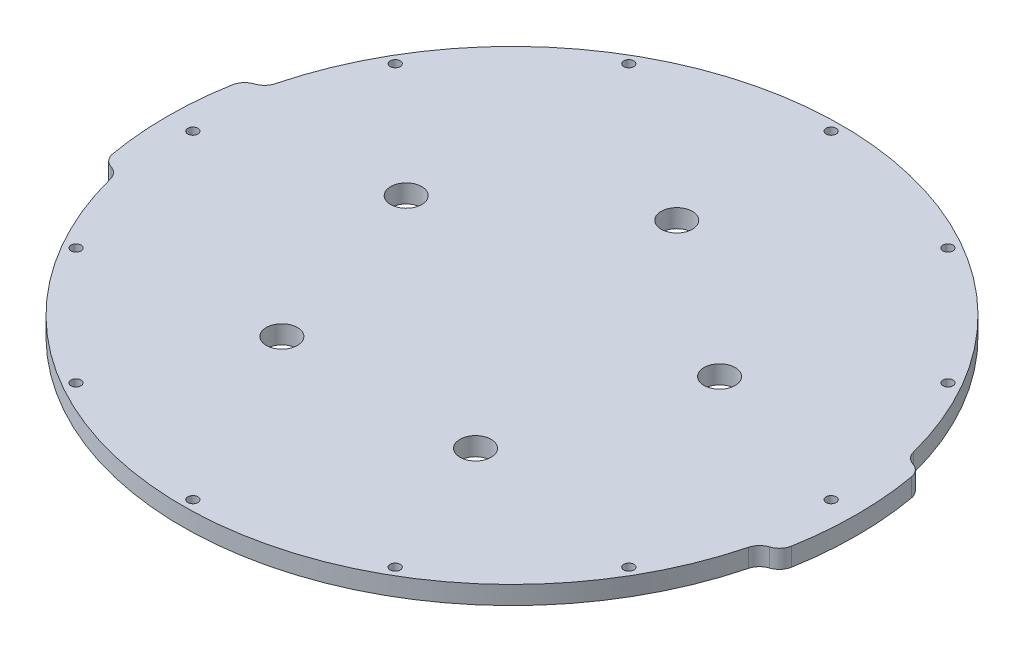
ISO-10303-21;
HEADER;
FILE_DESCRIPTION(('STEP AP214'),'2;1');
FILE_NAME('part.step','',(''),(''),'','','');
FILE_SCHEMA(('AUTOMOTIVE_DESIGN { 1 0 10303 214 1 1 1 1 }'));
ENDSEC;
DATA;
#1=APPLICATION_CONTEXT('core data for automotive mechanical design processes');
#2=APPLICATION_PROTOCOL_DEFINITION('international standard','automotive_design',2000,#1);
#3=PRODUCT_CONTEXT('',#1,'mechanical');
#4=PRODUCT('Part','Part','',(#3));
#5=PRODUCT_RELATED_PRODUCT_CATEGORY('part','',(#4));
#6=PRODUCT_DEFINITION_FORMATION('','',#4);
#7=PRODUCT_DEFINITION_CONTEXT('part definition',#1,'design');
#8=PRODUCT_DEFINITION('design','',#6,#7);
#9=PRODUCT_DEFINITION_SHAPE('','',#8);
#10=(LENGTH_UNIT() NAMED_UNIT(*) SI_UNIT(.MILLI.,.METRE.));
#11=(NAMED_UNIT(*) PLANE_ANGLE_UNIT() SI_UNIT($,.RADIAN.));
#12=(NAMED_UNIT(*) SI_UNIT($,.STERADIAN.) SOLID_ANGLE_UNIT());
#13=UNCERTAINTY_MEASURE_WITH_UNIT(LENGTH_MEASURE(1.E-05),#10,'distance_accuracy_value','');
#14=(GEOMETRIC_REPRESENTATION_CONTEXT(3) GLOBAL_UNCERTAINTY_ASSIGNED_CONTEXT((#13)) GLOBAL_UNIT_ASSIGNED_CONTEXT((#10,
#11,#12)) REPRESENTATION_CONTEXT('',''));
#15=CARTESIAN_POINT('',(0.,0.,0.));
#16=DIRECTION('',(0.,0.,1.));
#17=DIRECTION('',(1.,0.,0.));
#18=AXIS2_PLACEMENT_3D('',#15,#16,#17);
#19=CARTESIAN_POINT('',(-53.1549984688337,6.,-9.37266038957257));
#20=DIRECTION('',(0.,-1.,0.));
#21=DIRECTION('',(0.,0.,-1.));
#22=AXIS2_PLACEMENT_3D('',#19,#20,#21);
#23=PLANE('',#22);
#24=CARTESIAN_POINT('',(-51.3332754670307,6.,-16.6791922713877));
#25=DIRECTION('',(0.,1.,0.));
#26=DIRECTION('',(0.,0.,1.));
#27=AXIS2_PLACEMENT_3D('',#24,#25,#26);
#28=CIRCLE('',#27,5.1);
#29=CARTESIAN_POINT('',(-51.3332754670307,6.,-11.5791922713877));
#30=VERTEX_POINT('',#29);
#31=EDGE_CURVE('E396',#30,#30,#28,.T.);
#32=ORIENTED_EDGE('',*,*,#31,.F.);
#33=EDGE_LOOP('',(#32));
#34=FACE_BOUND('',#33,.T.);
#35=CARTESIAN_POINT('',(-31.7257089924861,6.,43.6666922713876));
#36=DIRECTION('',(0.,1.,0.));
#37=DIRECTION('',(0.,0.,1.));
#38=AXIS2_PLACEMENT_3D('',#35,#36,#37);
#39=CIRCLE('',#38,5.1);
#40=CARTESIAN_POINT('',(-31.7257089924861,6.,48.7666922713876));
#41=VERTEX_POINT('',#40);
#42=EDGE_CURVE('E390',#41,#41,#39,.T.);
#43=ORIENTED_EDGE('',*,*,#42,.F.);
#44=EDGE_LOOP('',(#43));
#45=FACE_BOUND('',#44,.T.);
#46=CARTESIAN_POINT('',(31.7257089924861,6.,43.6666922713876));
#47=DIRECTION('',(0.,1.,0.));
#48=DIRECTION('',(0.,0.,1.));
#49=AXIS2_PLACEMENT_3D('',#46,#47,#48);
#50=CIRCLE('',#49,5.09999999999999);
#51=CARTESIAN_POINT('',(31.7257089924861,6.,48.7666922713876));
#52=VERTEX_POINT('',#51);
#53=EDGE_CURVE('E384',#52,#52,#50,.T.);
#54=ORIENTED_EDGE('',*,*,#53,.F.);
#55=EDGE_LOOP('',(#54));
#56=FACE_BOUND('',#55,.T.);
#57=CARTESIAN_POINT('',(51.3332754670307,6.,-16.6791922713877));
#58=DIRECTION('',(0.,1.,0.));
#59=DIRECTION('',(0.,0.,1.));
#60=AXIS2_PLACEMENT_3D('',#57,#58,#59);
#61=CIRCLE('',#60,5.09999999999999);
#62=CARTESIAN_POINT('',(51.3332754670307,6.,-11.5791922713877));
#63=VERTEX_POINT('',#62);
#64=EDGE_CURVE('E378',#63,#63,#61,.T.);
#65=ORIENTED_EDGE('',*,*,#64,.F.);
#66=EDGE_LOOP('',(#65));
#67=FACE_BOUND('',#66,.T.);
#68=CARTESIAN_POINT('',(0.,6.,-53.9749999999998));
#69=DIRECTION('',(0.,1.,0.));
#70=DIRECTION('',(0.,0.,1.));
#71=AXIS2_PLACEMENT_3D('',#68,#69,#70);
#72=CIRCLE('',#71,5.1);
#73=CARTESIAN_POINT('',(0.,6.,-48.8749999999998));
#74=VERTEX_POINT('',#73);
#75=EDGE_CURVE('E372',#74,#74,#72,.T.);
#76=ORIENTED_EDGE('',*,*,#75,.F.);
#77=EDGE_LOOP('',(#76));
#78=FACE_BOUND('',#77,.T.);
#79=CARTESIAN_POINT('',(-90.5429559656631,6.,-52.2749999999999));
#80=DIRECTION('',(0.,1.,0.));
#81=DIRECTION('',(0.,0.,1.));
#82=AXIS2_PLACEMENT_3D('',#79,#80,#81);
#83=CIRCLE('',#82,1.65000000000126);
#84=CARTESIAN_POINT('',(-90.5429559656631,6.,-50.6249999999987));
#85=VERTEX_POINT('',#84);
#86=EDGE_CURVE('E357',#85,#85,#83,.T.);
#87=ORIENTED_EDGE('',*,*,#86,.F.);
#88=EDGE_LOOP('',(#87));
#89=FACE_BOUND('',#88,.T.);
#90=CARTESIAN_POINT('',(-90.542955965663,6.,52.2750000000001));
#91=DIRECTION('',(0.,1.,0.));
#92=DIRECTION('',(0.,0.,1.));
#93=AXIS2_PLACEMENT_3D('',#90,#91,#92);
#94=CIRCLE('',#93,1.65000000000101);
#95=CARTESIAN_POINT('',(-90.542955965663,6.,53.9250000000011));
#96=VERTEX_POINT('',#95);
#97=EDGE_CURVE('E345',#96,#96,#94,.T.);
#98=ORIENTED_EDGE('',*,*,#97,.F.);
#99=EDGE_LOOP('',(#98));
#100=FACE_BOUND('',#99,.T.);
#101=CARTESIAN_POINT('',(0.,6.,104.55));
#102=DIRECTION('',(0.,1.,0.));
#103=DIRECTION('',(0.,0.,1.));
#104=AXIS2_PLACEMENT_3D('',#101,#102,#103);
#105=CIRCLE('',#104,1.65000000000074);
#106=CARTESIAN_POINT('',(0.,6.,106.200000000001));
#107=VERTEX_POINT('',#106);
#108=EDGE_CURVE('E333',#107,#107,#105,.T.);
#109=ORIENTED_EDGE('',*,*,#108,.F.);
#110=EDGE_LOOP('',(#109));
#111=FACE_BOUND('',#110,.T.);
#112=CARTESIAN_POINT('',(90.5429559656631,6.,52.275));
#113=DIRECTION('',(0.,1.,0.));
#114=DIRECTION('',(0.,0.,1.));
#115=AXIS2_PLACEMENT_3D('',#112,#113,#114);
#116=CIRCLE('',#115,1.65000000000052);
#117=CARTESIAN_POINT('',(90.5429559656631,6.,53.9250000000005));
#118=VERTEX_POINT('',#117);
#119=EDGE_CURVE('E321',#118,#118,#116,.T.);
#120=ORIENTED_EDGE('',*,*,#119,.F.);
#121=EDGE_LOOP('',(#120));
#122=FACE_BOUND('',#121,.T.);
#123=CARTESIAN_POINT('',(90.5429559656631,6.,-52.275));
#124=DIRECTION('',(0.,1.,0.));
#125=DIRECTION('',(0.,0.,1.));
#126=AXIS2_PLACEMENT_3D('',#123,#124,#125);
#127=CIRCLE('',#126,1.65000000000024);
#128=CARTESIAN_POINT('',(90.5429559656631,6.,-50.6249999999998));
#129=VERTEX_POINT('',#128);
#130=EDGE_CURVE('E309',#129,#129,#127,.T.);
#131=ORIENTED_EDGE('',*,*,#130,.F.);
#132=EDGE_LOOP('',(#131));
#133=FACE_BOUND('',#132,.T.);
#134=CARTESIAN_POINT('',(0.,6.,-104.55));
#135=DIRECTION('',(0.,1.,0.));
#136=DIRECTION('',(0.,0.,1.));
#137=AXIS2_PLACEMENT_3D('',#134,#135,#136);
#138=CIRCLE('',#137,1.65);
#139=CARTESIAN_POINT('',(0.,6.,-102.9));
#140=VERTEX_POINT('',#139);
#141=EDGE_CURVE('E277',#140,#140,#138,.T.);
#142=ORIENTED_EDGE('',*,*,#141,.F.);
#143=EDGE_LOOP('',(#142));
#144=FACE_BOUND('',#143,.T.);
#145=CARTESIAN_POINT('',(0.,6.,0.));
#146=DIRECTION('',(0.,1.,0.));
#147=DIRECTION('',(0.,0.,-1.));
#148=AXIS2_PLACEMENT_3D('',#145,#146,#147);
#149=CIRCLE('',#148,107.95);
#150=CARTESIAN_POINT('',(104.513991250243,6.,-27.0190327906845));
#151=VERTEX_POINT('',#150);
#152=CARTESIAN_POINT('',(-104.513991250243,6.,-27.0190327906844));
#153=VERTEX_POINT('',#152);
#154=EDGE_CURVE('E272',#151,#153,#149,.T.);
#155=ORIENTED_EDGE('',*,*,#154,.T.);
#156=CARTESIAN_POINT('',(-109.354843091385,6.,-28.2704933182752));
#157=DIRECTION('',(0.,-1.,0.));
#158=DIRECTION('',(0.,0.,-1.));
#159=AXIS2_PLACEMENT_3D('',#156,#157,#158);
#160=CIRCLE('',#159,5.);
#161=CARTESIAN_POINT('',(-107.832420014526,6.,-23.5079070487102));
#162=VERTEX_POINT('',#161);
#163=EDGE_CURVE('E127',#153,#162,#160,.T.);
#164=ORIENTED_EDGE('',*,*,#163,.T.);
#165=CARTESIAN_POINT('',(-106.309996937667,6.,-18.7453207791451));
#166=DIRECTION('',(0.,1.,0.));
#167=DIRECTION('',(0.,0.,-1.));
#168=AXIS2_PLACEMENT_3D('',#165,#166,#167);
#169=CIRCLE('',#168,5.00000000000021);
#170=CARTESIAN_POINT('',(-111.234035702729,6.,-19.6135616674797));
#171=VERTEX_POINT('',#170);
#172=EDGE_CURVE('E120',#162,#171,#169,.T.);
#173=ORIENTED_EDGE('',*,*,#172,.T.);
#174=CARTESIAN_POINT('',(0.,6.,0.));
#175=DIRECTION('',(0.,1.,0.));
#176=DIRECTION('',(0.,0.,-1.));
#177=AXIS2_PLACEMENT_3D('',#174,#175,#176);
#178=CIRCLE('',#177,112.95);
#179=CARTESIAN_POINT('',(-111.234035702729,6.,19.6135616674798));
#180=VERTEX_POINT('',#179);
#181=EDGE_CURVE('E124',#171,#180,#178,.T.);
#182=ORIENTED_EDGE('',*,*,#181,.T.);
#183=CARTESIAN_POINT('',(-106.309996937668,6.,18.7453207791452));
#184=DIRECTION('',(0.,1.,0.));
#185=DIRECTION('',(0.,0.,1.));
#186=AXIS2_PLACEMENT_3D('',#183,#184,#185);
#187=CIRCLE('',#186,5.00000000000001);
#188=CARTESIAN_POINT('',(-107.832420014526,6.,23.5079070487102));
#189=VERTEX_POINT('',#188);
#190=EDGE_CURVE('E140',#180,#189,#187,.T.);
#191=ORIENTED_EDGE('',*,*,#190,.T.);
#192=CARTESIAN_POINT('',(-109.354843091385,6.,28.2704933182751));
#193=DIRECTION('',(0.,-1.,0.));
#194=DIRECTION('',(0.,0.,-1.));
#195=AXIS2_PLACEMENT_3D('',#192,#193,#194);
#196=CIRCLE('',#195,5.);
#197=CARTESIAN_POINT('',(-104.513991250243,6.,27.0190327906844));
#198=VERTEX_POINT('',#197);
#199=EDGE_CURVE('E11',#189,#198,#196,.T.);
#200=ORIENTED_EDGE('',*,*,#199,.T.);
#201=CARTESIAN_POINT('',(0.,6.,-4.92661467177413E-13));
#202=DIRECTION('',(0.,1.,0.));
#203=DIRECTION('',(0.,0.,-1.));
#204=AXIS2_PLACEMENT_3D('',#201,#202,#203);
#205=CIRCLE('',#204,107.95);
#206=CARTESIAN_POINT('',(104.513991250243,6.,27.0190327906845));
#207=VERTEX_POINT('',#206);
#208=EDGE_CURVE('E259',#198,#207,#205,.T.);
#209=ORIENTED_EDGE('',*,*,#208,.T.);
#210=CARTESIAN_POINT('',(109.354843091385,6.,28.2704933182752));
#211=DIRECTION('',(0.,-1.,0.));
#212=DIRECTION('',(0.,0.,-1.));
#213=AXIS2_PLACEMENT_3D('',#210,#211,#212);
#214=CIRCLE('',#213,5.);
#215=CARTESIAN_POINT('',(107.832420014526,6.,23.5079070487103));
#216=VERTEX_POINT('',#215);
#217=EDGE_CURVE('E171',#207,#216,#214,.T.);
#218=ORIENTED_EDGE('',*,*,#217,.T.);
#219=CARTESIAN_POINT('',(106.309996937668,6.,18.7453207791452));
#220=DIRECTION('',(0.,1.,0.));
#221=DIRECTION('',(0.,0.,-1.));
#222=AXIS2_PLACEMENT_3D('',#219,#220,#221);
#223=CIRCLE('',#222,5.00000000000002);
#224=CARTESIAN_POINT('',(111.234035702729,6.,19.6135616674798));
#225=VERTEX_POINT('',#224);
#226=EDGE_CURVE('E256',#216,#225,#223,.T.);
#227=ORIENTED_EDGE('',*,*,#226,.T.);
#228=CARTESIAN_POINT('',(-1.29063426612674E-12,6.,0.));
#229=DIRECTION('',(0.,1.,0.));
#230=DIRECTION('',(0.,0.,1.));
#231=AXIS2_PLACEMENT_3D('',#228,#229,#230);
#232=CIRCLE('',#231,112.950000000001);
#233=CARTESIAN_POINT('',(111.234035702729,6.,-19.6135616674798));
#234=VERTEX_POINT('',#233);
#235=EDGE_CURVE('E263',#225,#234,#232,.T.);
#236=ORIENTED_EDGE('',*,*,#235,.T.);
#237=CARTESIAN_POINT('',(106.309996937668,6.,-18.7453207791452));
#238=DIRECTION('',(0.,1.,0.));
#239=DIRECTION('',(0.,0.,1.));
#240=AXIS2_PLACEMENT_3D('',#237,#238,#239);
#241=CIRCLE('',#240,5.);
#242=CARTESIAN_POINT('',(107.832420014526,6.,-23.5079070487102));
#243=VERTEX_POINT('',#242);
#244=EDGE_CURVE('E265',#234,#243,#241,.T.);
#245=ORIENTED_EDGE('',*,*,#244,.T.);
#246=CARTESIAN_POINT('',(109.354843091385,6.,-28.2704933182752));
#247=DIRECTION('',(0.,-1.,0.));
#248=DIRECTION('',(0.,0.,-1.));
#249=AXIS2_PLACEMENT_3D('',#246,#247,#248);
#250=CIRCLE('',#249,5.);
#251=EDGE_CURVE('E175',#243,#151,#250,.T.);
#252=ORIENTED_EDGE('',*,*,#251,.T.);
#253=EDGE_LOOP('',(#155,#164,#173,#182,#191,#200,#209,#218,#227,#236,#245,#252));
#254=FACE_BOUND('',#253,.T.);
#255=CARTESIAN_POINT('',(52.275,6.,-90.5429559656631));
#256=DIRECTION('',(0.,1.,0.));
#257=DIRECTION('',(0.,0.,1.));
#258=AXIS2_PLACEMENT_3D('',#255,#256,#257);
#259=CIRCLE('',#258,1.65000000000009);
#260=CARTESIAN_POINT('',(52.275,6.,-88.892955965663));
#261=VERTEX_POINT('',#260);
#262=EDGE_CURVE('E303',#261,#261,#259,.T.);
#263=ORIENTED_EDGE('',*,*,#262,.F.);
#264=EDGE_LOOP('',(#263));
#265=FACE_BOUND('',#264,.T.);
#266=CARTESIAN_POINT('',(104.55,6.,0.));
#267=DIRECTION('',(0.,1.,0.));
#268=DIRECTION('',(0.,0.,1.));
#269=AXIS2_PLACEMENT_3D('',#266,#267,#268);
#270=CIRCLE('',#269,1.65000000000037);
#271=CARTESIAN_POINT('',(104.55,6.,1.65000000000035));
#272=VERTEX_POINT('',#271);
#273=EDGE_CURVE('E315',#272,#272,#270,.T.);
#274=ORIENTED_EDGE('',*,*,#273,.F.);
#275=EDGE_LOOP('',(#274));
#276=FACE_BOUND('',#275,.T.);
#277=CARTESIAN_POINT('',(52.2750000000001,6.,90.542955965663));
#278=DIRECTION('',(0.,1.,0.));
#279=DIRECTION('',(0.,0.,1.));
#280=AXIS2_PLACEMENT_3D('',#277,#278,#279);
#281=CIRCLE('',#280,1.65000000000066);
#282=CARTESIAN_POINT('',(52.2750000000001,6.,92.1929559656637));
#283=VERTEX_POINT('',#282);
#284=EDGE_CURVE('E327',#283,#283,#281,.T.);
#285=ORIENTED_EDGE('',*,*,#284,.F.);
#286=EDGE_LOOP('',(#285));
#287=FACE_BOUND('',#286,.T.);
#288=CARTESIAN_POINT('',(-52.2749999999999,6.,90.5429559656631));
#289=DIRECTION('',(0.,1.,0.));
#290=DIRECTION('',(0.,0.,1.));
#291=AXIS2_PLACEMENT_3D('',#288,#289,#290);
#292=CIRCLE('',#291,1.65000000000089);
#293=CARTESIAN_POINT('',(-52.2749999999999,6.,92.192955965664));
#294=VERTEX_POINT('',#293);
#295=EDGE_CURVE('E339',#294,#294,#292,.T.);
#296=ORIENTED_EDGE('',*,*,#295,.F.);
#297=EDGE_LOOP('',(#296));
#298=FACE_BOUND('',#297,.T.);
#299=CARTESIAN_POINT('',(-104.55,6.,0.));
#300=DIRECTION('',(0.,1.,0.));
#301=DIRECTION('',(0.,0.,1.));
#302=AXIS2_PLACEMENT_3D('',#299,#300,#301);
#303=CIRCLE('',#302,1.65000000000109);
#304=CARTESIAN_POINT('',(-104.55,6.,1.65000000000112));
#305=VERTEX_POINT('',#304);
#306=EDGE_CURVE('E351',#305,#305,#303,.T.);
#307=ORIENTED_EDGE('',*,*,#306,.F.);
#308=EDGE_LOOP('',(#307));
#309=FACE_BOUND('',#308,.T.);
#310=CARTESIAN_POINT('',(-52.275,6.,-90.542955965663));
#311=DIRECTION('',(0.,1.,0.));
#312=DIRECTION('',(0.,0.,1.));
#313=AXIS2_PLACEMENT_3D('',#310,#311,#312);
#314=CIRCLE('',#313,1.65000000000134);
#315=CARTESIAN_POINT('',(-52.275,6.,-88.8929559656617));
#316=VERTEX_POINT('',#315);
#317=EDGE_CURVE('E363',#316,#316,#314,.T.);
#318=ORIENTED_EDGE('',*,*,#317,.F.);
#319=EDGE_LOOP('',(#318));
#320=FACE_BOUND('',#319,.T.);
#321=ADVANCED_FACE('F32',(#34,#45,#56,#67,#78,#89,#100,#111,#122,#133,#144,#254,#265,#276,#287,
#298,#309,#320),#23,.F.);
#322=CARTESIAN_POINT('',(-53.1549984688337,0.,-9.37266038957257));
#323=DIRECTION('',(0.,-1.,0.));
#324=DIRECTION('',(0.,0.,-1.));
#325=AXIS2_PLACEMENT_3D('',#322,#323,#324);
#326=PLANE('',#325);
#327=CARTESIAN_POINT('',(-51.3332754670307,0.,-16.6791922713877));
#328=DIRECTION('',(0.,1.,0.));
#329=DIRECTION('',(0.,0.,1.));
#330=AXIS2_PLACEMENT_3D('',#327,#328,#329);
#331=CIRCLE('',#330,5.1);
#332=CARTESIAN_POINT('',(-51.3332754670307,0.,-11.5791922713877));
#333=VERTEX_POINT('',#332);
#334=EDGE_CURVE('E393',#333,#333,#331,.T.);
#335=ORIENTED_EDGE('',*,*,#334,.T.);
#336=EDGE_LOOP('',(#335));
#337=FACE_BOUND('',#336,.T.);
#338=CARTESIAN_POINT('',(-31.7257089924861,0.,43.6666922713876));
#339=DIRECTION('',(0.,1.,0.));
#340=DIRECTION('',(0.,0.,1.));
#341=AXIS2_PLACEMENT_3D('',#338,#339,#340);
#342=CIRCLE('',#341,5.1);
#343=CARTESIAN_POINT('',(-31.7257089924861,0.,48.7666922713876));
#344=VERTEX_POINT('',#343);
#345=EDGE_CURVE('E387',#344,#344,#342,.T.);
#346=ORIENTED_EDGE('',*,*,#345,.T.);
#347=EDGE_LOOP('',(#346));
#348=FACE_BOUND('',#347,.T.);
#349=CARTESIAN_POINT('',(31.7257089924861,0.,43.6666922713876));
#350=DIRECTION('',(0.,1.,0.));
#351=DIRECTION('',(0.,0.,1.));
#352=AXIS2_PLACEMENT_3D('',#349,#350,#351);
#353=CIRCLE('',#352,5.09999999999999);
#354=CARTESIAN_POINT('',(31.7257089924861,0.,48.7666922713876));
#355=VERTEX_POINT('',#354);
#356=EDGE_CURVE('E381',#355,#355,#353,.T.);
#357=ORIENTED_EDGE('',*,*,#356,.T.);
#358=EDGE_LOOP('',(#357));
#359=FACE_BOUND('',#358,.T.);
#360=CARTESIAN_POINT('',(51.3332754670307,0.,-16.6791922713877));
#361=DIRECTION('',(0.,1.,0.));
#362=DIRECTION('',(0.,0.,1.));
#363=AXIS2_PLACEMENT_3D('',#360,#361,#362);
#364=CIRCLE('',#363,5.09999999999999);
#365=CARTESIAN_POINT('',(51.3332754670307,0.,-11.5791922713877));
#366=VERTEX_POINT('',#365);
#367=EDGE_CURVE('E375',#366,#366,#364,.T.);
#368=ORIENTED_EDGE('',*,*,#367,.T.);
#369=EDGE_LOOP('',(#368));
#370=FACE_BOUND('',#369,.T.);
#371=CARTESIAN_POINT('',(0.,0.,-53.9749999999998));
#372=DIRECTION('',(0.,1.,0.));
#373=DIRECTION('',(0.,0.,1.));
#374=AXIS2_PLACEMENT_3D('',#371,#372,#373);
#375=CIRCLE('',#374,5.1);
#376=CARTESIAN_POINT('',(0.,0.,-48.8749999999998));
#377=VERTEX_POINT('',#376);
#378=EDGE_CURVE('E369',#377,#377,#375,.T.);
#379=ORIENTED_EDGE('',*,*,#378,.T.);
#380=EDGE_LOOP('',(#379));
#381=FACE_BOUND('',#380,.T.);
#382=CARTESIAN_POINT('',(-90.5429559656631,0.,-52.2749999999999));
#383=DIRECTION('',(0.,1.,0.));
#384=DIRECTION('',(0.,0.,1.));
#385=AXIS2_PLACEMENT_3D('',#382,#383,#384);
#386=CIRCLE('',#385,1.65000000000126);
#387=CARTESIAN_POINT('',(-90.5429559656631,0.,-50.6249999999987));
#388=VERTEX_POINT('',#387);
#389=EDGE_CURVE('E360',#388,#388,#386,.T.);
#390=ORIENTED_EDGE('',*,*,#389,.T.);
#391=EDGE_LOOP('',(#390));
#392=FACE_BOUND('',#391,.T.);
#393=CARTESIAN_POINT('',(-90.542955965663,0.,52.2750000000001));
#394=DIRECTION('',(0.,1.,0.));
#395=DIRECTION('',(0.,0.,1.));
#396=AXIS2_PLACEMENT_3D('',#393,#394,#395);
#397=CIRCLE('',#396,1.65000000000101);
#398=CARTESIAN_POINT('',(-90.542955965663,0.,53.9250000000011));
#399=VERTEX_POINT('',#398);
#400=EDGE_CURVE('E348',#399,#399,#397,.T.);
#401=ORIENTED_EDGE('',*,*,#400,.T.);
#402=EDGE_LOOP('',(#401));
#403=FACE_BOUND('',#402,.T.);
#404=CARTESIAN_POINT('',(0.,0.,104.55));
#405=DIRECTION('',(0.,1.,0.));
#406=DIRECTION('',(0.,0.,1.));
#407=AXIS2_PLACEMENT_3D('',#404,#405,#406);
#408=CIRCLE('',#407,1.65000000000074);
#409=CARTESIAN_POINT('',(0.,0.,106.200000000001));
#410=VERTEX_POINT('',#409);
#411=EDGE_CURVE('E336',#410,#410,#408,.T.);
#412=ORIENTED_EDGE('',*,*,#411,.T.);
#413=EDGE_LOOP('',(#412));
#414=FACE_BOUND('',#413,.T.);
#415=CARTESIAN_POINT('',(90.5429559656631,0.,52.275));
#416=DIRECTION('',(0.,1.,0.));
#417=DIRECTION('',(0.,0.,1.));
#418=AXIS2_PLACEMENT_3D('',#415,#416,#417);
#419=CIRCLE('',#418,1.65000000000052);
#420=CARTESIAN_POINT('',(90.5429559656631,0.,53.9250000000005));
#421=VERTEX_POINT('',#420);
#422=EDGE_CURVE('E324',#421,#421,#419,.T.);
#423=ORIENTED_EDGE('',*,*,#422,.T.);
#424=EDGE_LOOP('',(#423));
#425=FACE_BOUND('',#424,.T.);
#426=CARTESIAN_POINT('',(90.5429559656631,0.,-52.275));
#427=DIRECTION('',(0.,1.,0.));
#428=DIRECTION('',(0.,0.,1.));
#429=AXIS2_PLACEMENT_3D('',#426,#427,#428);
#430=CIRCLE('',#429,1.65000000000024);
#431=CARTESIAN_POINT('',(90.5429559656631,0.,-50.6249999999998));
#432=VERTEX_POINT('',#431);
#433=EDGE_CURVE('E312',#432,#432,#430,.T.);
#434=ORIENTED_EDGE('',*,*,#433,.T.);
#435=EDGE_LOOP('',(#434));
#436=FACE_BOUND('',#435,.T.);
#437=CARTESIAN_POINT('',(0.,0.,-104.55));
#438=DIRECTION('',(0.,1.,0.));
#439=DIRECTION('',(0.,0.,1.));
#440=AXIS2_PLACEMENT_3D('',#437,#438,#439);
#441=CIRCLE('',#440,1.65);
#442=CARTESIAN_POINT('',(0.,0.,-102.9));
#443=VERTEX_POINT('',#442);
#444=EDGE_CURVE('E300',#443,#443,#441,.T.);
#445=ORIENTED_EDGE('',*,*,#444,.T.);
#446=EDGE_LOOP('',(#445));
#447=FACE_BOUND('',#446,.T.);
#448=CARTESIAN_POINT('',(-106.309996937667,0.,-18.7453207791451));
#449=DIRECTION('',(0.,1.,0.));
#450=DIRECTION('',(0.,0.,-1.));
#451=AXIS2_PLACEMENT_3D('',#448,#449,#450);
#452=CIRCLE('',#451,5.00000000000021);
#453=CARTESIAN_POINT('',(-107.832420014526,0.,-23.5079070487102));
#454=VERTEX_POINT('',#453);
#455=CARTESIAN_POINT('',(-111.234035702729,0.,-19.6135616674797));
#456=VERTEX_POINT('',#455);
#457=EDGE_CURVE('E144',#454,#456,#452,.T.);
#458=ORIENTED_EDGE('',*,*,#457,.F.);
#459=CARTESIAN_POINT('',(-109.354843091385,0.,-28.2704933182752));
#460=DIRECTION('',(0.,-1.,0.));
#461=DIRECTION('',(0.,0.,-1.));
#462=AXIS2_PLACEMENT_3D('',#459,#460,#461);
#463=CIRCLE('',#462,5.);
#464=CARTESIAN_POINT('',(-104.513991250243,0.,-27.0190327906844));
#465=VERTEX_POINT('',#464);
#466=EDGE_CURVE('E177',#454,#465,#463,.F.);
#467=ORIENTED_EDGE('',*,*,#466,.T.);
#468=CARTESIAN_POINT('',(0.,0.,0.));
#469=DIRECTION('',(0.,1.,0.));
#470=DIRECTION('',(0.,0.,-1.));
#471=AXIS2_PLACEMENT_3D('',#468,#469,#470);
#472=CIRCLE('',#471,107.95);
#473=CARTESIAN_POINT('',(104.513991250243,0.,-27.0190327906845));
#474=VERTEX_POINT('',#473);
#475=EDGE_CURVE('E132',#474,#465,#472,.T.);
#476=ORIENTED_EDGE('',*,*,#475,.F.);
#477=CARTESIAN_POINT('',(109.354843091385,0.,-28.2704933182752));
#478=DIRECTION('',(0.,-1.,0.));
#479=DIRECTION('',(0.,0.,-1.));
#480=AXIS2_PLACEMENT_3D('',#477,#478,#479);
#481=CIRCLE('',#480,5.);
#482=CARTESIAN_POINT('',(107.832420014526,0.,-23.5079070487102));
#483=VERTEX_POINT('',#482);
#484=EDGE_CURVE('E173',#474,#483,#481,.F.);
#485=ORIENTED_EDGE('',*,*,#484,.T.);
#486=CARTESIAN_POINT('',(106.309996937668,0.,-18.7453207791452));
#487=DIRECTION('',(0.,1.,0.));
#488=DIRECTION('',(0.,0.,1.));
#489=AXIS2_PLACEMENT_3D('',#486,#487,#488);
#490=CIRCLE('',#489,5.);
#491=CARTESIAN_POINT('',(111.234035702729,0.,-19.6135616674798));
#492=VERTEX_POINT('',#491);
#493=EDGE_CURVE('E189',#492,#483,#490,.T.);
#494=ORIENTED_EDGE('',*,*,#493,.F.);
#495=CARTESIAN_POINT('',(-1.29063426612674E-12,0.,0.));
#496=DIRECTION('',(0.,1.,0.));
#497=DIRECTION('',(0.,0.,1.));
#498=AXIS2_PLACEMENT_3D('',#495,#496,#497);
#499=CIRCLE('',#498,112.950000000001);
#500=CARTESIAN_POINT('',(111.234035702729,0.,19.6135616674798));
#501=VERTEX_POINT('',#500);
#502=EDGE_CURVE('E286',#501,#492,#499,.T.);
#503=ORIENTED_EDGE('',*,*,#502,.F.);
#504=CARTESIAN_POINT('',(106.309996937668,0.,18.7453207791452));
#505=DIRECTION('',(0.,1.,0.));
#506=DIRECTION('',(0.,0.,-1.));
#507=AXIS2_PLACEMENT_3D('',#504,#505,#506);
#508=CIRCLE('',#507,5.00000000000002);
#509=CARTESIAN_POINT('',(107.832420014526,0.,23.5079070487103));
#510=VERTEX_POINT('',#509);
#511=EDGE_CURVE('E284',#510,#501,#508,.T.);
#512=ORIENTED_EDGE('',*,*,#511,.F.);
#513=CARTESIAN_POINT('',(109.354843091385,0.,28.2704933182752));
#514=DIRECTION('',(0.,-1.,0.));
#515=DIRECTION('',(0.,0.,-1.));
#516=AXIS2_PLACEMENT_3D('',#513,#514,#515);
#517=CIRCLE('',#516,5.);
#518=CARTESIAN_POINT('',(104.513991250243,0.,27.0190327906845));
#519=VERTEX_POINT('',#518);
#520=EDGE_CURVE('E169',#510,#519,#517,.F.);
#521=ORIENTED_EDGE('',*,*,#520,.T.);
#522=CARTESIAN_POINT('',(0.,0.,-4.92661467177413E-13));
#523=DIRECTION('',(0.,1.,0.));
#524=DIRECTION('',(0.,0.,-1.));
#525=AXIS2_PLACEMENT_3D('',#522,#523,#524);
#526=CIRCLE('',#525,107.95);
#527=CARTESIAN_POINT('',(-104.513991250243,0.,27.0190327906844));
#528=VERTEX_POINT('',#527);
#529=EDGE_CURVE('E281',#528,#519,#526,.T.);
#530=ORIENTED_EDGE('',*,*,#529,.F.);
#531=CARTESIAN_POINT('',(-109.354843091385,0.,28.2704933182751));
#532=DIRECTION('',(0.,-1.,0.));
#533=DIRECTION('',(0.,0.,-1.));
#534=AXIS2_PLACEMENT_3D('',#531,#532,#533);
#535=CIRCLE('',#534,5.);
#536=CARTESIAN_POINT('',(-107.832420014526,0.,23.5079070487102));
#537=VERTEX_POINT('',#536);
#538=EDGE_CURVE('E40',#528,#537,#535,.F.);
#539=ORIENTED_EDGE('',*,*,#538,.T.);
#540=CARTESIAN_POINT('',(-106.309996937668,0.,18.7453207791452));
#541=DIRECTION('',(0.,1.,0.));
#542=DIRECTION('',(0.,0.,1.));
#543=AXIS2_PLACEMENT_3D('',#540,#541,#542);
#544=CIRCLE('',#543,5.00000000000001);
#545=CARTESIAN_POINT('',(-111.234035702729,0.,19.6135616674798));
#546=VERTEX_POINT('',#545);
#547=EDGE_CURVE('E279',#546,#537,#544,.T.);
#548=ORIENTED_EDGE('',*,*,#547,.F.);
#549=CARTESIAN_POINT('',(0.,0.,0.));
#550=DIRECTION('',(0.,1.,0.));
#551=DIRECTION('',(0.,0.,-1.));
#552=AXIS2_PLACEMENT_3D('',#549,#550,#551);
#553=CIRCLE('',#552,112.95);
#554=EDGE_CURVE('E276',#456,#546,#553,.T.);
#555=ORIENTED_EDGE('',*,*,#554,.F.);
#556=EDGE_LOOP('',(#458,#467,#476,#485,#494,#503,#512,#521,#530,#539,#548,#555));
#557=FACE_BOUND('',#556,.T.);
#558=CARTESIAN_POINT('',(52.275,0.,-90.5429559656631));
#559=DIRECTION('',(0.,1.,0.));
#560=DIRECTION('',(0.,0.,1.));
#561=AXIS2_PLACEMENT_3D('',#558,#559,#560);
#562=CIRCLE('',#561,1.65000000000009);
#563=CARTESIAN_POINT('',(52.275,0.,-88.892955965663));
#564=VERTEX_POINT('',#563);
#565=EDGE_CURVE('E306',#564,#564,#562,.T.);
#566=ORIENTED_EDGE('',*,*,#565,.T.);
#567=EDGE_LOOP('',(#566));
#568=FACE_BOUND('',#567,.T.);
#569=CARTESIAN_POINT('',(104.55,0.,0.));
#570=DIRECTION('',(0.,1.,0.));
#571=DIRECTION('',(0.,0.,1.));
#572=AXIS2_PLACEMENT_3D('',#569,#570,#571);
#573=CIRCLE('',#572,1.65000000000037);
#574=CARTESIAN_POINT('',(104.55,0.,1.65000000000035));
#575=VERTEX_POINT('',#574);
#576=EDGE_CURVE('E318',#575,#575,#573,.T.);
#577=ORIENTED_EDGE('',*,*,#576,.T.);
#578=EDGE_LOOP('',(#577));
#579=FACE_BOUND('',#578,.T.);
#580=CARTESIAN_POINT('',(52.2750000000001,0.,90.542955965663));
#581=DIRECTION('',(0.,1.,0.));
#582=DIRECTION('',(0.,0.,1.));
#583=AXIS2_PLACEMENT_3D('',#580,#581,#582);
#584=CIRCLE('',#583,1.65000000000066);
#585=CARTESIAN_POINT('',(52.2750000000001,0.,92.1929559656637));
#586=VERTEX_POINT('',#585);
#587=EDGE_CURVE('E330',#586,#586,#584,.T.);
#588=ORIENTED_EDGE('',*,*,#587,.T.);
#589=EDGE_LOOP('',(#588));
#590=FACE_BOUND('',#589,.T.);
#591=CARTESIAN_POINT('',(-52.2749999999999,0.,90.5429559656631));
#592=DIRECTION('',(0.,1.,0.));
#593=DIRECTION('',(0.,0.,1.));
#594=AXIS2_PLACEMENT_3D('',#591,#592,#593);
#595=CIRCLE('',#594,1.65000000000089);
#596=CARTESIAN_POINT('',(-52.2749999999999,0.,92.192955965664));
#597=VERTEX_POINT('',#596);
#598=EDGE_CURVE('E342',#597,#597,#595,.T.);
#599=ORIENTED_EDGE('',*,*,#598,.T.);
#600=EDGE_LOOP('',(#599));
#601=FACE_BOUND('',#600,.T.);
#602=CARTESIAN_POINT('',(-104.55,0.,0.));
#603=DIRECTION('',(0.,1.,0.));
#604=DIRECTION('',(0.,0.,1.));
#605=AXIS2_PLACEMENT_3D('',#602,#603,#604);
#606=CIRCLE('',#605,1.65000000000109);
#607=CARTESIAN_POINT('',(-104.55,0.,1.65000000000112));
#608=VERTEX_POINT('',#607);
#609=EDGE_CURVE('E354',#608,#608,#606,.T.);
#610=ORIENTED_EDGE('',*,*,#609,.T.);
#611=EDGE_LOOP('',(#610));
#612=FACE_BOUND('',#611,.T.);
#613=CARTESIAN_POINT('',(-52.275,0.,-90.542955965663));
#614=DIRECTION('',(0.,1.,0.));
#615=DIRECTION('',(0.,0.,1.));
#616=AXIS2_PLACEMENT_3D('',#613,#614,#615);
#617=CIRCLE('',#616,1.65000000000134);
#618=CARTESIAN_POINT('',(-52.275,0.,-88.8929559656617));
#619=VERTEX_POINT('',#618);
#620=EDGE_CURVE('E366',#619,#619,#617,.T.);
#621=ORIENTED_EDGE('',*,*,#620,.T.);
#622=EDGE_LOOP('',(#621));
#623=FACE_BOUND('',#622,.T.);
#624=ADVANCED_FACE('F181',(#337,#348,#359,#370,#381,#392,#403,#414,#425,#436,#447,#557,#568,
#579,#590,#601,#612,#623),#326,.T.);
#625=CARTESIAN_POINT('',(-106.309996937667,6.,-18.7453207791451));
#626=DIRECTION('',(0.,-1.,0.));
#627=DIRECTION('',(0.,0.,-1.));
#628=AXIS2_PLACEMENT_3D('',#625,#626,#627);
#629=CYLINDRICAL_SURFACE('',#628,5.00000000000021);
#630=ORIENTED_EDGE('',*,*,#172,.F.);
#631=DIRECTION('',(0.,-1.,0.));
#632=VECTOR('',#631,1.);
#633=CARTESIAN_POINT('',(-107.832420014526,6.,-23.5079070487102));
#634=LINE('',#633,#632);
#635=EDGE_CURVE('E166',#162,#454,#634,.T.);
#636=ORIENTED_EDGE('',*,*,#635,.T.);
#637=ORIENTED_EDGE('',*,*,#457,.T.);
#638=DIRECTION('',(0.,-1.,0.));
#639=VECTOR('',#638,1.);
#640=CARTESIAN_POINT('',(-111.234035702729,6.,-19.6135616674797));
#641=LINE('',#640,#639);
#642=EDGE_CURVE('E137',#171,#456,#641,.T.);
#643=ORIENTED_EDGE('',*,*,#642,.F.);
#644=EDGE_LOOP('',(#630,#636,#637,#643));
#645=FACE_BOUND('',#644,.T.);
#646=ADVANCED_FACE('F142',(#645),#629,.T.);
#647=CARTESIAN_POINT('',(0.,6.,0.));
#648=DIRECTION('',(0.,-1.,0.));
#649=DIRECTION('',(0.,0.,-1.));
#650=AXIS2_PLACEMENT_3D('',#647,#648,#649);
#651=CYLINDRICAL_SURFACE('',#650,112.95);
#652=ORIENTED_EDGE('',*,*,#554,.T.);
#653=DIRECTION('',(0.,-1.,0.));
#654=VECTOR('',#653,1.);
#655=CARTESIAN_POINT('',(-111.234035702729,6.,19.6135616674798));
#656=LINE('',#655,#654);
#657=EDGE_CURVE('E139',#180,#546,#656,.T.);
#658=ORIENTED_EDGE('',*,*,#657,.F.);
#659=ORIENTED_EDGE('',*,*,#181,.F.);
#660=ORIENTED_EDGE('',*,*,#642,.T.);
#661=EDGE_LOOP('',(#652,#658,#659,#660));
#662=FACE_BOUND('',#661,.T.);
#663=ADVANCED_FACE('F136',(#662),#651,.T.);
#664=CARTESIAN_POINT('',(-106.309996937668,6.,18.7453207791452));
#665=DIRECTION('',(0.,-1.,0.));
#666=DIRECTION('',(0.,0.,-1.));
#667=AXIS2_PLACEMENT_3D('',#664,#665,#666);
#668=CYLINDRICAL_SURFACE('',#667,5.00000000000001);
#669=ORIENTED_EDGE('',*,*,#547,.T.);
#670=DIRECTION('',(0.,-1.,0.));
#671=VECTOR('',#670,1.);
#672=CARTESIAN_POINT('',(-107.832420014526,6.,23.5079070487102));
#673=LINE('',#672,#671);
#674=EDGE_CURVE('E47',#537,#189,#673,.F.);
#675=ORIENTED_EDGE('',*,*,#674,.T.);
#676=ORIENTED_EDGE('',*,*,#190,.F.);
#677=ORIENTED_EDGE('',*,*,#657,.T.);
#678=EDGE_LOOP('',(#669,#675,#676,#677));
#679=FACE_BOUND('',#678,.T.);
#680=ADVANCED_FACE('F234',(#679),#668,.T.);
#681=CARTESIAN_POINT('',(0.,6.,-4.92661467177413E-13));
#682=DIRECTION('',(0.,-1.,0.));
#683=DIRECTION('',(0.,0.,-1.));
#684=AXIS2_PLACEMENT_3D('',#681,#682,#683);
#685=CYLINDRICAL_SURFACE('',#684,107.95);
#686=ORIENTED_EDGE('',*,*,#529,.T.);
#687=DIRECTION('',(0.,-1.,0.));
#688=VECTOR('',#687,1.);
#689=CARTESIAN_POINT('',(104.513991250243,6.,27.0190327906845));
#690=LINE('',#689,#688);
#691=EDGE_CURVE('E157',#519,#207,#690,.F.);
#692=ORIENTED_EDGE('',*,*,#691,.T.);
#693=ORIENTED_EDGE('',*,*,#208,.F.);
#694=DIRECTION('',(0.,-1.,0.));
#695=VECTOR('',#694,1.);
#696=CARTESIAN_POINT('',(-104.513991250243,6.,27.0190327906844));
#697=LINE('',#696,#695);
#698=EDGE_CURVE('E149',#198,#528,#697,.T.);
#699=ORIENTED_EDGE('',*,*,#698,.T.);
#700=EDGE_LOOP('',(#686,#692,#693,#699));
#701=FACE_BOUND('',#700,.T.);
#702=ADVANCED_FACE('F230',(#701),#685,.T.);
#703=CARTESIAN_POINT('',(106.309996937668,6.,18.7453207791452));
#704=DIRECTION('',(0.,-1.,0.));
#705=DIRECTION('',(0.,0.,-1.));
#706=AXIS2_PLACEMENT_3D('',#703,#704,#705);
#707=CYLINDRICAL_SURFACE('',#706,5.00000000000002);
#708=ORIENTED_EDGE('',*,*,#226,.F.);
#709=DIRECTION('',(0.,-1.,0.));
#710=VECTOR('',#709,1.);
#711=CARTESIAN_POINT('',(107.832420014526,6.,23.5079070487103));
#712=LINE('',#711,#710);
#713=EDGE_CURVE('E146',#216,#510,#712,.T.);
#714=ORIENTED_EDGE('',*,*,#713,.T.);
#715=ORIENTED_EDGE('',*,*,#511,.T.);
#716=DIRECTION('',(0.,-1.,0.));
#717=VECTOR('',#716,1.);
#718=CARTESIAN_POINT('',(111.234035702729,6.,19.6135616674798));
#719=LINE('',#718,#717);
#720=EDGE_CURVE('E151',#225,#501,#719,.T.);
#721=ORIENTED_EDGE('',*,*,#720,.F.);
#722=EDGE_LOOP('',(#708,#714,#715,#721));
#723=FACE_BOUND('',#722,.T.);
#724=ADVANCED_FACE('F226',(#723),#707,.T.);
#725=CARTESIAN_POINT('',(-1.29063426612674E-12,6.,0.));
#726=DIRECTION('',(0.,-1.,0.));
#727=DIRECTION('',(0.,0.,-1.));
#728=AXIS2_PLACEMENT_3D('',#725,#726,#727);
#729=CYLINDRICAL_SURFACE('',#728,112.950000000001);
#730=ORIENTED_EDGE('',*,*,#502,.T.);
#731=DIRECTION('',(0.,-1.,0.));
#732=VECTOR('',#731,1.);
#733=CARTESIAN_POINT('',(111.234035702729,6.,-19.6135616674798));
#734=LINE('',#733,#732);
#735=EDGE_CURVE('E274',#234,#492,#734,.T.);
#736=ORIENTED_EDGE('',*,*,#735,.F.);
#737=ORIENTED_EDGE('',*,*,#235,.F.);
#738=ORIENTED_EDGE('',*,*,#720,.T.);
#739=EDGE_LOOP('',(#730,#736,#737,#738));
#740=FACE_BOUND('',#739,.T.);
#741=ADVANCED_FACE('F222',(#740),#729,.T.);
#742=CARTESIAN_POINT('',(106.309996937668,6.,-18.7453207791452));
#743=DIRECTION('',(0.,-1.,0.));
#744=DIRECTION('',(0.,0.,-1.));
#745=AXIS2_PLACEMENT_3D('',#742,#743,#744);
#746=CYLINDRICAL_SURFACE('',#745,5.);
#747=ORIENTED_EDGE('',*,*,#493,.T.);
#748=DIRECTION('',(0.,-1.,0.));
#749=VECTOR('',#748,1.);
#750=CARTESIAN_POINT('',(107.832420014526,6.,-23.5079070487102));
#751=LINE('',#750,#749);
#752=EDGE_CURVE('E164',#483,#243,#751,.F.);
#753=ORIENTED_EDGE('',*,*,#752,.T.);
#754=ORIENTED_EDGE('',*,*,#244,.F.);
#755=ORIENTED_EDGE('',*,*,#735,.T.);
#756=EDGE_LOOP('',(#747,#753,#754,#755));
#757=FACE_BOUND('',#756,.T.);
#758=ADVANCED_FACE('F219',(#757),#746,.T.);
#759=CARTESIAN_POINT('',(0.,6.,0.));
#760=DIRECTION('',(0.,-1.,0.));
#761=DIRECTION('',(0.,0.,-1.));
#762=AXIS2_PLACEMENT_3D('',#759,#760,#761);
#763=CYLINDRICAL_SURFACE('',#762,107.95);
#764=ORIENTED_EDGE('',*,*,#154,.F.);
#765=DIRECTION('',(0.,-1.,0.));
#766=VECTOR('',#765,1.);
#767=CARTESIAN_POINT('',(104.513991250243,6.,-27.0190327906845));
#768=LINE('',#767,#766);
#769=EDGE_CURVE('E161',#151,#474,#768,.T.);
#770=ORIENTED_EDGE('',*,*,#769,.T.);
#771=ORIENTED_EDGE('',*,*,#475,.T.);
#772=DIRECTION('',(0.,-1.,0.));
#773=VECTOR('',#772,1.);
#774=CARTESIAN_POINT('',(-104.513991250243,6.,-27.0190327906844));
#775=LINE('',#774,#773);
#776=EDGE_CURVE('E159',#465,#153,#775,.F.);
#777=ORIENTED_EDGE('',*,*,#776,.T.);
#778=EDGE_LOOP('',(#764,#770,#771,#777));
#779=FACE_BOUND('',#778,.T.);
#780=ADVANCED_FACE('F187',(#779),#763,.T.);
#781=CARTESIAN_POINT('',(0.,6.,-104.55));
#782=DIRECTION('',(0.,-1.,0.));
#783=DIRECTION('',(0.,0.,-1.));
#784=AXIS2_PLACEMENT_3D('',#781,#782,#783);
#785=CYLINDRICAL_SURFACE('',#784,1.65);
#786=ORIENTED_EDGE('',*,*,#141,.T.);
#787=EDGE_LOOP('',(#786));
#788=FACE_BOUND('',#787,.T.);
#789=ORIENTED_EDGE('',*,*,#444,.F.);
#790=EDGE_LOOP('',(#789));
#791=FACE_BOUND('',#790,.T.);
#792=ADVANCED_FACE('F214',(#788,#791),#785,.F.);
#793=CARTESIAN_POINT('',(52.275,6.,-90.5429559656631));
#794=DIRECTION('',(0.,-1.,0.));
#795=DIRECTION('',(0.,0.,-1.));
#796=AXIS2_PLACEMENT_3D('',#793,#794,#795);
#797=CYLINDRICAL_SURFACE('',#796,1.65000000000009);
#798=ORIENTED_EDGE('',*,*,#262,.T.);
#799=EDGE_LOOP('',(#798));
#800=FACE_BOUND('',#799,.T.);
#801=ORIENTED_EDGE('',*,*,#565,.F.);
#802=EDGE_LOOP('',(#801));
#803=FACE_BOUND('',#802,.T.);
#804=ADVANCED_FACE('F458',(#800,#803),#797,.F.);
#805=CARTESIAN_POINT('',(90.5429559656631,6.,-52.275));
#806=DIRECTION('',(0.,-1.,0.));
#807=DIRECTION('',(0.,0.,-1.));
#808=AXIS2_PLACEMENT_3D('',#805,#806,#807);
#809=CYLINDRICAL_SURFACE('',#808,1.65000000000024);
#810=ORIENTED_EDGE('',*,*,#130,.T.);
#811=EDGE_LOOP('',(#810));
#812=FACE_BOUND('',#811,.T.);
#813=ORIENTED_EDGE('',*,*,#433,.F.);
#814=EDGE_LOOP('',(#813));
#815=FACE_BOUND('',#814,.T.);
#816=ADVANCED_FACE('F455',(#812,#815),#809,.F.);
#817=CARTESIAN_POINT('',(104.55,6.,0.));
#818=DIRECTION('',(0.,-1.,0.));
#819=DIRECTION('',(0.,0.,-1.));
#820=AXIS2_PLACEMENT_3D('',#817,#818,#819);
#821=CYLINDRICAL_SURFACE('',#820,1.65000000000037);
#822=ORIENTED_EDGE('',*,*,#273,.T.);
#823=EDGE_LOOP('',(#822));
#824=FACE_BOUND('',#823,.T.);
#825=ORIENTED_EDGE('',*,*,#576,.F.);
#826=EDGE_LOOP('',(#825));
#827=FACE_BOUND('',#826,.T.);
#828=ADVANCED_FACE('F451',(#824,#827),#821,.F.);
#829=CARTESIAN_POINT('',(90.5429559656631,6.,52.275));
#830=DIRECTION('',(0.,-1.,0.));
#831=DIRECTION('',(0.,0.,-1.));
#832=AXIS2_PLACEMENT_3D('',#829,#830,#831);
#833=CYLINDRICAL_SURFACE('',#832,1.65000000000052);
#834=ORIENTED_EDGE('',*,*,#119,.T.);
#835=EDGE_LOOP('',(#834));
#836=FACE_BOUND('',#835,.T.);
#837=ORIENTED_EDGE('',*,*,#422,.F.);
#838=EDGE_LOOP('',(#837));
#839=FACE_BOUND('',#838,.T.);
#840=ADVANCED_FACE('F447',(#836,#839),#833,.F.);
#841=CARTESIAN_POINT('',(52.2750000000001,6.,90.542955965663));
#842=DIRECTION('',(0.,-1.,0.));
#843=DIRECTION('',(0.,0.,-1.));
#844=AXIS2_PLACEMENT_3D('',#841,#842,#843);
#845=CYLINDRICAL_SURFACE('',#844,1.65000000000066);
#846=ORIENTED_EDGE('',*,*,#284,.T.);
#847=EDGE_LOOP('',(#846));
#848=FACE_BOUND('',#847,.T.);
#849=ORIENTED_EDGE('',*,*,#587,.F.);
#850=EDGE_LOOP('',(#849));
#851=FACE_BOUND('',#850,.T.);
#852=ADVANCED_FACE('F443',(#848,#851),#845,.F.);
#853=CARTESIAN_POINT('',(0.,6.,104.55));
#854=DIRECTION('',(0.,-1.,0.));
#855=DIRECTION('',(0.,0.,-1.));
#856=AXIS2_PLACEMENT_3D('',#853,#854,#855);
#857=CYLINDRICAL_SURFACE('',#856,1.65000000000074);
#858=ORIENTED_EDGE('',*,*,#108,.T.);
#859=EDGE_LOOP('',(#858));
#860=FACE_BOUND('',#859,.T.);
#861=ORIENTED_EDGE('',*,*,#411,.F.);
#862=EDGE_LOOP('',(#861));
#863=FACE_BOUND('',#862,.T.);
#864=ADVANCED_FACE('F439',(#860,#863),#857,.F.);
#865=CARTESIAN_POINT('',(-52.2749999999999,6.,90.5429559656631));
#866=DIRECTION('',(0.,-1.,0.));
#867=DIRECTION('',(0.,0.,-1.));
#868=AXIS2_PLACEMENT_3D('',#865,#866,#867);
#869=CYLINDRICAL_SURFACE('',#868,1.65000000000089);
#870=ORIENTED_EDGE('',*,*,#295,.T.);
#871=EDGE_LOOP('',(#870));
#872=FACE_BOUND('',#871,.T.);
#873=ORIENTED_EDGE('',*,*,#598,.F.);
#874=EDGE_LOOP('',(#873));
#875=FACE_BOUND('',#874,.T.);
#876=ADVANCED_FACE('F435',(#872,#875),#869,.F.);
#877=CARTESIAN_POINT('',(-90.542955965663,6.,52.2750000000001));
#878=DIRECTION('',(0.,-1.,0.));
#879=DIRECTION('',(0.,0.,-1.));
#880=AXIS2_PLACEMENT_3D('',#877,#878,#879);
#881=CYLINDRICAL_SURFACE('',#880,1.65000000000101);
#882=ORIENTED_EDGE('',*,*,#97,.T.);
#883=EDGE_LOOP('',(#882));
#884=FACE_BOUND('',#883,.T.);
#885=ORIENTED_EDGE('',*,*,#400,.F.);
#886=EDGE_LOOP('',(#885));
#887=FACE_BOUND('',#886,.T.);
#888=ADVANCED_FACE('F431',(#884,#887),#881,.F.);
#889=CARTESIAN_POINT('',(-104.55,6.,0.));
#890=DIRECTION('',(0.,-1.,0.));
#891=DIRECTION('',(0.,0.,-1.));
#892=AXIS2_PLACEMENT_3D('',#889,#890,#891);
#893=CYLINDRICAL_SURFACE('',#892,1.65000000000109);
#894=ORIENTED_EDGE('',*,*,#306,.T.);
#895=EDGE_LOOP('',(#894));
#896=FACE_BOUND('',#895,.T.);
#897=ORIENTED_EDGE('',*,*,#609,.F.);
#898=EDGE_LOOP('',(#897));
#899=FACE_BOUND('',#898,.T.);
#900=ADVANCED_FACE('F427',(#896,#899),#893,.F.);
#901=CARTESIAN_POINT('',(-90.5429559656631,6.,-52.2749999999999));
#902=DIRECTION('',(0.,-1.,0.));
#903=DIRECTION('',(0.,0.,-1.));
#904=AXIS2_PLACEMENT_3D('',#901,#902,#903);
#905=CYLINDRICAL_SURFACE('',#904,1.65000000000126);
#906=ORIENTED_EDGE('',*,*,#86,.T.);
#907=EDGE_LOOP('',(#906));
#908=FACE_BOUND('',#907,.T.);
#909=ORIENTED_EDGE('',*,*,#389,.F.);
#910=EDGE_LOOP('',(#909));
#911=FACE_BOUND('',#910,.T.);
#912=ADVANCED_FACE('F248',(#908,#911),#905,.F.);
#913=CARTESIAN_POINT('',(-52.275,6.,-90.542955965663));
#914=DIRECTION('',(0.,-1.,0.));
#915=DIRECTION('',(0.,0.,-1.));
#916=AXIS2_PLACEMENT_3D('',#913,#914,#915);
#917=CYLINDRICAL_SURFACE('',#916,1.65000000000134);
#918=ORIENTED_EDGE('',*,*,#317,.T.);
#919=EDGE_LOOP('',(#918));
#920=FACE_BOUND('',#919,.T.);
#921=ORIENTED_EDGE('',*,*,#620,.F.);
#922=EDGE_LOOP('',(#921));
#923=FACE_BOUND('',#922,.T.);
#924=ADVANCED_FACE('F243',(#920,#923),#917,.F.);
#925=CARTESIAN_POINT('',(109.354843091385,6.,28.2704933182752));
#926=DIRECTION('',(0.,1.,0.));
#927=DIRECTION('',(0.,0.,1.));
#928=AXIS2_PLACEMENT_3D('',#925,#926,#927);
#929=CYLINDRICAL_SURFACE('',#928,5.);
#930=ORIENTED_EDGE('',*,*,#217,.F.);
#931=ORIENTED_EDGE('',*,*,#691,.F.);
#932=ORIENTED_EDGE('',*,*,#520,.F.);
#933=ORIENTED_EDGE('',*,*,#713,.F.);
#934=EDGE_LOOP('',(#930,#931,#932,#933));
#935=FACE_BOUND('',#934,.T.);
#936=ADVANCED_FACE('F200',(#935),#929,.F.);
#937=CARTESIAN_POINT('',(109.354843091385,6.,-28.2704933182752));
#938=DIRECTION('',(0.,1.,0.));
#939=DIRECTION('',(0.,0.,1.));
#940=AXIS2_PLACEMENT_3D('',#937,#938,#939);
#941=CYLINDRICAL_SURFACE('',#940,5.);
#942=ORIENTED_EDGE('',*,*,#251,.F.);
#943=ORIENTED_EDGE('',*,*,#752,.F.);
#944=ORIENTED_EDGE('',*,*,#484,.F.);
#945=ORIENTED_EDGE('',*,*,#769,.F.);
#946=EDGE_LOOP('',(#942,#943,#944,#945));
#947=FACE_BOUND('',#946,.T.);
#948=ADVANCED_FACE('F193',(#947),#941,.F.);
#949=CARTESIAN_POINT('',(-109.354843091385,6.,-28.2704933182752));
#950=DIRECTION('',(0.,1.,0.));
#951=DIRECTION('',(0.,0.,1.));
#952=AXIS2_PLACEMENT_3D('',#949,#950,#951);
#953=CYLINDRICAL_SURFACE('',#952,5.);
#954=ORIENTED_EDGE('',*,*,#163,.F.);
#955=ORIENTED_EDGE('',*,*,#776,.F.);
#956=ORIENTED_EDGE('',*,*,#466,.F.);
#957=ORIENTED_EDGE('',*,*,#635,.F.);
#958=EDGE_LOOP('',(#954,#955,#956,#957));
#959=FACE_BOUND('',#958,.T.);
#960=ADVANCED_FACE('F191',(#959),#953,.F.);
#961=CARTESIAN_POINT('',(-109.354843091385,6.,28.2704933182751));
#962=DIRECTION('',(0.,1.,0.));
#963=DIRECTION('',(0.,0.,1.));
#964=AXIS2_PLACEMENT_3D('',#961,#962,#963);
#965=CYLINDRICAL_SURFACE('',#964,5.);
#966=ORIENTED_EDGE('',*,*,#199,.F.);
#967=ORIENTED_EDGE('',*,*,#674,.F.);
#968=ORIENTED_EDGE('',*,*,#538,.F.);
#969=ORIENTED_EDGE('',*,*,#698,.F.);
#970=EDGE_LOOP('',(#966,#967,#968,#969));
#971=FACE_BOUND('',#970,.T.);
#972=ADVANCED_FACE('F34',(#971),#965,.F.);
#973=CARTESIAN_POINT('',(0.,0.,-53.9749999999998));
#974=DIRECTION('',(0.,1.,0.));
#975=DIRECTION('',(0.,0.,1.));
#976=AXIS2_PLACEMENT_3D('',#973,#974,#975);
#977=CYLINDRICAL_SURFACE('',#976,5.1);
#978=ORIENTED_EDGE('',*,*,#378,.F.);
#979=EDGE_LOOP('',(#978));
#980=FACE_BOUND('',#979,.T.);
#981=ORIENTED_EDGE('',*,*,#75,.T.);
#982=EDGE_LOOP('',(#981));
#983=FACE_BOUND('',#982,.T.);
#984=ADVANCED_FACE('F198',(#980,#983),#977,.F.);
#985=CARTESIAN_POINT('',(51.3332754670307,0.,-16.6791922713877));
#986=DIRECTION('',(0.,1.,0.));
#987=DIRECTION('',(0.,0.,1.));
#988=AXIS2_PLACEMENT_3D('',#985,#986,#987);
#989=CYLINDRICAL_SURFACE('',#988,5.09999999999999);
#990=ORIENTED_EDGE('',*,*,#367,.F.);
#991=EDGE_LOOP('',(#990));
#992=FACE_BOUND('',#991,.T.);
#993=ORIENTED_EDGE('',*,*,#64,.T.);
#994=EDGE_LOOP('',(#993));
#995=FACE_BOUND('',#994,.T.);
#996=ADVANCED_FACE('F417',(#992,#995),#989,.F.);
#997=CARTESIAN_POINT('',(31.7257089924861,0.,43.6666922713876));
#998=DIRECTION('',(0.,1.,0.));
#999=DIRECTION('',(0.,0.,1.));
#1000=AXIS2_PLACEMENT_3D('',#997,#998,#999);
#1001=CYLINDRICAL_SURFACE('',#1000,5.09999999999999);
#1002=ORIENTED_EDGE('',*,*,#356,.F.);
#1003=EDGE_LOOP('',(#1002));
#1004=FACE_BOUND('',#1003,.T.);
#1005=ORIENTED_EDGE('',*,*,#53,.T.);
#1006=EDGE_LOOP('',(#1005));
#1007=FACE_BOUND('',#1006,.T.);
#1008=ADVANCED_FACE('F411',(#1004,#1007),#1001,.F.);
#1009=CARTESIAN_POINT('',(-31.7257089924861,0.,43.6666922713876));
#1010=DIRECTION('',(0.,1.,0.));
#1011=DIRECTION('',(0.,0.,1.));
#1012=AXIS2_PLACEMENT_3D('',#1009,#1010,#1011);
#1013=CYLINDRICAL_SURFACE('',#1012,5.1);
#1014=ORIENTED_EDGE('',*,*,#345,.F.);
#1015=EDGE_LOOP('',(#1014));
#1016=FACE_BOUND('',#1015,.T.);
#1017=ORIENTED_EDGE('',*,*,#42,.T.);
#1018=EDGE_LOOP('',(#1017));
#1019=FACE_BOUND('',#1018,.T.);
#1020=ADVANCED_FACE('F406',(#1016,#1019),#1013,.F.);
#1021=CARTESIAN_POINT('',(-51.3332754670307,0.,-16.6791922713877));
#1022=DIRECTION('',(0.,1.,0.));
#1023=DIRECTION('',(0.,0.,1.));
#1024=AXIS2_PLACEMENT_3D('',#1021,#1022,#1023);
#1025=CYLINDRICAL_SURFACE('',#1024,5.1);
#1026=ORIENTED_EDGE('',*,*,#334,.F.);
#1027=EDGE_LOOP('',(#1026));
#1028=FACE_BOUND('',#1027,.T.);
#1029=ORIENTED_EDGE('',*,*,#31,.T.);
#1030=EDGE_LOOP('',(#1029));
#1031=FACE_BOUND('',#1030,.T.);
#1032=ADVANCED_FACE('F403',(#1028,#1031),#1025,.F.);
#1033=CLOSED_SHELL('',(#321,#624,#646,#663,#680,#702,#724,#741,#758,#780,#792,#804,#816,#828,
#840,#852,#864,#876,#888,#900,#912,#924,#936,#948,#960,#972,#984,#996,#1008,#1020,#1032));
#1034=MANIFOLD_SOLID_BREP('B2',#1033);
#1035=ADVANCED_BREP_SHAPE_REPRESENTATION('',(#18,#1034),#14);
#1036=SHAPE_DEFINITION_REPRESENTATION(#9,#1035);
ENDSEC;
END-ISO-10303-21;
